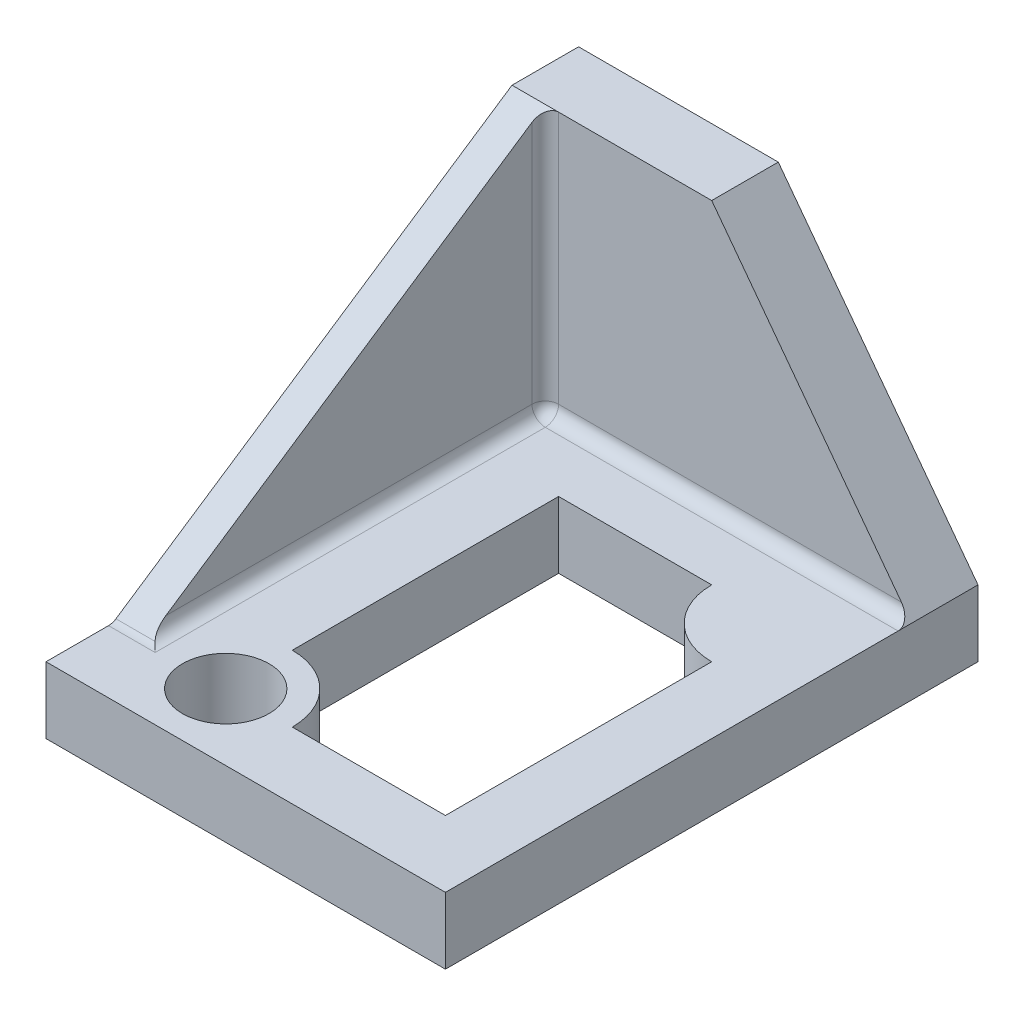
ISO-10303-21;
HEADER;
FILE_DESCRIPTION(('STEP AP214'),'2;1');
FILE_NAME('part.step','',(''),(''),'','','');
FILE_SCHEMA(('AUTOMOTIVE_DESIGN { 1 0 10303 214 1 1 1 1 }'));
ENDSEC;
DATA;
#1=APPLICATION_CONTEXT('core data for automotive mechanical design processes');
#2=APPLICATION_PROTOCOL_DEFINITION('international standard','automotive_design',2000,#1);
#3=PRODUCT_CONTEXT('',#1,'mechanical');
#4=PRODUCT('Part','Part','',(#3));
#5=PRODUCT_RELATED_PRODUCT_CATEGORY('part','',(#4));
#6=PRODUCT_DEFINITION_FORMATION('','',#4);
#7=PRODUCT_DEFINITION_CONTEXT('part definition',#1,'design');
#8=PRODUCT_DEFINITION('design','',#6,#7);
#9=PRODUCT_DEFINITION_SHAPE('','',#8);
#10=(LENGTH_UNIT() NAMED_UNIT(*) SI_UNIT(.MILLI.,.METRE.));
#11=(NAMED_UNIT(*) PLANE_ANGLE_UNIT() SI_UNIT($,.RADIAN.));
#12=(NAMED_UNIT(*) SI_UNIT($,.STERADIAN.) SOLID_ANGLE_UNIT());
#13=UNCERTAINTY_MEASURE_WITH_UNIT(LENGTH_MEASURE(1.E-05),#10,'distance_accuracy_value','');
#14=(GEOMETRIC_REPRESENTATION_CONTEXT(3) GLOBAL_UNCERTAINTY_ASSIGNED_CONTEXT((#13)) GLOBAL_UNIT_ASSIGNED_CONTEXT((#10,
#11,#12)) REPRESENTATION_CONTEXT('',''));
#15=CARTESIAN_POINT('',(0.,0.,0.));
#16=DIRECTION('',(0.,0.,1.));
#17=DIRECTION('',(1.,0.,0.));
#18=AXIS2_PLACEMENT_3D('',#15,#16,#17);
#19=CARTESIAN_POINT('',(0.,0.,101.6));
#20=DIRECTION('',(0.,-1.,0.));
#21=DIRECTION('',(0.,0.,-1.));
#22=AXIS2_PLACEMENT_3D('',#19,#20,#21);
#23=PLANE('',#22);
#24=CARTESIAN_POINT('',(21.59,0.,88.9));
#25=DIRECTION('',(0.,1.,0.));
#26=DIRECTION('',(0.,0.,1.));
#27=AXIS2_PLACEMENT_3D('',#24,#25,#26);
#28=CIRCLE('',#27,8.255);
#29=CARTESIAN_POINT('',(21.59,0.,97.155));
#30=VERTEX_POINT('',#29);
#31=EDGE_CURVE('E417',#30,#30,#28,.T.);
#32=ORIENTED_EDGE('',*,*,#31,.F.);
#33=EDGE_LOOP('',(#32));
#34=FACE_BOUND('',#33,.T.);
#35=DIRECTION('',(0.,0.,1.));
#36=VECTOR('',#35,1.);
#37=CARTESIAN_POINT('',(21.59,0.,25.4));
#38=LINE('',#37,#36);
#39=CARTESIAN_POINT('',(21.59,0.,25.4));
#40=VERTEX_POINT('',#39);
#41=CARTESIAN_POINT('',(21.59,0.,76.2));
#42=VERTEX_POINT('',#41);
#43=EDGE_CURVE('E156',#40,#42,#38,.T.);
#44=ORIENTED_EDGE('',*,*,#43,.F.);
#45=DIRECTION('',(-1.,0.,0.));
#46=VECTOR('',#45,1.);
#47=CARTESIAN_POINT('',(50.8,0.,25.4));
#48=LINE('',#47,#46);
#49=CARTESIAN_POINT('',(50.8,0.,25.4));
#50=VERTEX_POINT('',#49);
#51=EDGE_CURVE('E39',#50,#40,#48,.T.);
#52=ORIENTED_EDGE('',*,*,#51,.F.);
#53=CARTESIAN_POINT('',(63.5,0.,25.4));
#54=DIRECTION('',(0.,-1.,0.));
#55=DIRECTION('',(0.,0.,-1.));
#56=AXIS2_PLACEMENT_3D('',#53,#54,#55);
#57=CIRCLE('',#56,12.7);
#58=CARTESIAN_POINT('',(63.5,0.,38.1));
#59=VERTEX_POINT('',#58);
#60=EDGE_CURVE('E171',#59,#50,#57,.T.);
#61=ORIENTED_EDGE('',*,*,#60,.F.);
#62=DIRECTION('',(0.,0.,-1.));
#63=VECTOR('',#62,1.);
#64=CARTESIAN_POINT('',(63.5,0.,88.9));
#65=LINE('',#64,#63);
#66=CARTESIAN_POINT('',(63.5,0.,88.9));
#67=VERTEX_POINT('',#66);
#68=EDGE_CURVE('E165',#67,#59,#65,.T.);
#69=ORIENTED_EDGE('',*,*,#68,.F.);
#70=DIRECTION('',(1.,0.,0.));
#71=VECTOR('',#70,1.);
#72=CARTESIAN_POINT('',(34.29,0.,88.9));
#73=LINE('',#72,#71);
#74=CARTESIAN_POINT('',(34.29,0.,88.9));
#75=VERTEX_POINT('',#74);
#76=EDGE_CURVE('E163',#75,#67,#73,.T.);
#77=ORIENTED_EDGE('',*,*,#76,.F.);
#78=CARTESIAN_POINT('',(21.59,0.,88.9));
#79=DIRECTION('',(0.,-1.,0.));
#80=DIRECTION('',(0.,0.,1.));
#81=AXIS2_PLACEMENT_3D('',#78,#79,#80);
#82=CIRCLE('',#81,12.7);
#83=EDGE_CURVE('E147',#42,#75,#82,.T.);
#84=ORIENTED_EDGE('',*,*,#83,.F.);
#85=EDGE_LOOP('',(#44,#52,#61,#69,#77,#84));
#86=FACE_BOUND('',#85,.T.);
#87=DIRECTION('',(0.,0.,-1.));
#88=VECTOR('',#87,1.);
#89=CARTESIAN_POINT('',(76.2,0.,101.6));
#90=LINE('',#89,#88);
#91=CARTESIAN_POINT('',(76.2,0.,101.6));
#92=VERTEX_POINT('',#91);
#93=CARTESIAN_POINT('',(76.2,0.,15.24));
#94=VERTEX_POINT('',#93);
#95=EDGE_CURVE('E255',#92,#94,#90,.T.);
#96=ORIENTED_EDGE('',*,*,#95,.T.);
#97=DIRECTION('',(-1.,0.,0.));
#98=VECTOR('',#97,1.);
#99=CARTESIAN_POINT('',(6.35,0.,15.24));
#100=LINE('',#99,#98);
#101=CARTESIAN_POINT('',(8.89,0.,15.24));
#102=VERTEX_POINT('',#101);
#103=EDGE_CURVE('E269',#94,#102,#100,.T.);
#104=ORIENTED_EDGE('',*,*,#103,.T.);
#105=DIRECTION('',(0.,0.,1.));
#106=VECTOR('',#105,1.);
#107=CARTESIAN_POINT('',(8.89,0.,101.6));
#108=LINE('',#107,#106);
#109=CARTESIAN_POINT('',(8.89,0.,89.6690501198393));
#110=VERTEX_POINT('',#109);
#111=EDGE_CURVE('E321',#102,#110,#108,.T.);
#112=ORIENTED_EDGE('',*,*,#111,.T.);
#113=DIRECTION('',(-1.,0.,0.));
#114=VECTOR('',#113,1.);
#115=CARTESIAN_POINT('',(0.,0.,89.6690501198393));
#116=LINE('',#115,#114);
#117=CARTESIAN_POINT('',(0.,0.,89.6690501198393));
#118=VERTEX_POINT('',#117);
#119=EDGE_CURVE('E322',#110,#118,#116,.T.);
#120=ORIENTED_EDGE('',*,*,#119,.T.);
#121=DIRECTION('',(0.,0.,-1.));
#122=VECTOR('',#121,1.);
#123=CARTESIAN_POINT('',(0.,0.,101.6));
#124=LINE('',#123,#122);
#125=CARTESIAN_POINT('',(0.,0.,101.6));
#126=VERTEX_POINT('',#125);
#127=EDGE_CURVE('E252',#126,#118,#124,.T.);
#128=ORIENTED_EDGE('',*,*,#127,.F.);
#129=DIRECTION('',(-1.,0.,0.));
#130=VECTOR('',#129,1.);
#131=CARTESIAN_POINT('',(0.,0.,101.6));
#132=LINE('',#131,#130);
#133=EDGE_CURVE('E250',#92,#126,#132,.T.);
#134=ORIENTED_EDGE('',*,*,#133,.F.);
#135=EDGE_LOOP('',(#96,#104,#112,#120,#128,#134));
#136=FACE_BOUND('',#135,.T.);
#137=ADVANCED_FACE('F24',(#34,#86,#136),#23,.F.);
#138=CARTESIAN_POINT('',(6.35,59.2666666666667,0.));
#139=DIRECTION('',(1.,0.,0.));
#140=DIRECTION('',(0.,0.,-1.));
#141=AXIS2_PLACEMENT_3D('',#138,#139,#140);
#142=PLANE('',#141);
#143=DIRECTION('',(0.,0.,1.));
#144=VECTOR('',#143,1.);
#145=CARTESIAN_POINT('',(6.35,2.54,0.));
#146=LINE('',#145,#144);
#147=CARTESIAN_POINT('',(6.35,2.54,85.09));
#148=VERTEX_POINT('',#147);
#149=CARTESIAN_POINT('',(6.35,2.54,15.24));
#150=VERTEX_POINT('',#149);
#151=EDGE_CURVE('E264',#148,#150,#146,.F.);
#152=ORIENTED_EDGE('',*,*,#151,.T.);
#153=DIRECTION('',(0.,1.,0.));
#154=VECTOR('',#153,1.);
#155=CARTESIAN_POINT('',(6.35,59.2666666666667,15.24));
#156=LINE('',#155,#154);
#157=CARTESIAN_POINT('',(6.35,49.1066666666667,15.24));
#158=VERTEX_POINT('',#157);
#159=EDGE_CURVE('E292',#150,#158,#156,.T.);
#160=ORIENTED_EDGE('',*,*,#159,.T.);
#161=DIRECTION('',(0.,0.554700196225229,-0.832050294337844));
#162=VECTOR('',#161,1.);
#163=CARTESIAN_POINT('',(6.35,50.8,12.7));
#164=LINE('',#163,#162);
#165=EDGE_CURVE('E226',#148,#158,#164,.T.);
#166=ORIENTED_EDGE('',*,*,#165,.F.);
#167=EDGE_LOOP('',(#152,#160,#166));
#168=FACE_BOUND('',#167,.T.);
#169=ADVANCED_FACE('F289',(#168),#142,.T.);
#170=CARTESIAN_POINT('',(0.,-12.7,101.6));
#171=DIRECTION('',(1.,0.,0.));
#172=DIRECTION('',(0.,1.,0.));
#173=AXIS2_PLACEMENT_3D('',#170,#171,#172);
#174=PLANE('',#173);
#175=DIRECTION('',(0.,-1.,0.));
#176=VECTOR('',#175,1.);
#177=CARTESIAN_POINT('',(0.,-12.7,0.));
#178=LINE('',#177,#176);
#179=CARTESIAN_POINT('',(0.,50.8,0.));
#180=VERTEX_POINT('',#179);
#181=CARTESIAN_POINT('',(0.,-12.7,0.));
#182=VERTEX_POINT('',#181);
#183=EDGE_CURVE('E233',#180,#182,#178,.T.);
#184=ORIENTED_EDGE('',*,*,#183,.T.);
#185=DIRECTION('',(0.,0.,-1.));
#186=VECTOR('',#185,1.);
#187=CARTESIAN_POINT('',(0.,-12.7,101.6));
#188=LINE('',#187,#186);
#189=CARTESIAN_POINT('',(0.,-12.7,101.6));
#190=VERTEX_POINT('',#189);
#191=EDGE_CURVE('E261',#190,#182,#188,.T.);
#192=ORIENTED_EDGE('',*,*,#191,.F.);
#193=DIRECTION('',(0.,-1.,0.));
#194=VECTOR('',#193,1.);
#195=CARTESIAN_POINT('',(0.,-12.7,101.6));
#196=LINE('',#195,#194);
#197=EDGE_CURVE('E243',#126,#190,#196,.T.);
#198=ORIENTED_EDGE('',*,*,#197,.F.);
#199=ORIENTED_EDGE('',*,*,#127,.T.);
#200=CARTESIAN_POINT('',(0.,2.54,89.6690501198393));
#201=DIRECTION('',(1.,0.,0.));
#202=DIRECTION('',(0.,1.,0.));
#203=AXIS2_PLACEMENT_3D('',#200,#201,#202);
#204=CIRCLE('',#203,2.54);
#205=CARTESIAN_POINT('',(0.,0.426592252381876,88.2601116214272));
#206=VERTEX_POINT('',#205);
#207=EDGE_CURVE('E11',#118,#206,#204,.T.);
#208=ORIENTED_EDGE('',*,*,#207,.T.);
#209=DIRECTION('',(0.,0.554700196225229,-0.832050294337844));
#210=VECTOR('',#209,1.);
#211=CARTESIAN_POINT('',(0.,50.8,12.7));
#212=LINE('',#211,#210);
#213=CARTESIAN_POINT('',(0.,50.8,12.7));
#214=VERTEX_POINT('',#213);
#215=EDGE_CURVE('E220',#206,#214,#212,.T.);
#216=ORIENTED_EDGE('',*,*,#215,.T.);
#217=DIRECTION('',(0.,0.,-1.));
#218=VECTOR('',#217,1.);
#219=CARTESIAN_POINT('',(0.,50.8,0.));
#220=LINE('',#219,#218);
#221=EDGE_CURVE('E223',#214,#180,#220,.T.);
#222=ORIENTED_EDGE('',*,*,#221,.T.);
#223=EDGE_LOOP('',(#184,#192,#198,#199,#208,#216,#222));
#224=FACE_BOUND('',#223,.T.);
#225=ADVANCED_FACE('F26',(#224),#174,.F.);
#226=CARTESIAN_POINT('',(76.2,-12.7,101.6));
#227=DIRECTION('',(0.,1.,0.));
#228=DIRECTION('',(-1.,0.,0.));
#229=AXIS2_PLACEMENT_3D('',#226,#227,#228);
#230=PLANE('',#229);
#231=CARTESIAN_POINT('',(21.59,-12.7,88.9));
#232=DIRECTION('',(0.,1.,0.));
#233=DIRECTION('',(0.,0.,1.));
#234=AXIS2_PLACEMENT_3D('',#231,#232,#233);
#235=CIRCLE('',#234,8.255);
#236=CARTESIAN_POINT('',(21.59,-12.7,97.155));
#237=VERTEX_POINT('',#236);
#238=EDGE_CURVE('E415',#237,#237,#235,.T.);
#239=ORIENTED_EDGE('',*,*,#238,.T.);
#240=EDGE_LOOP('',(#239));
#241=FACE_BOUND('',#240,.T.);
#242=CARTESIAN_POINT('',(63.5,-12.7,25.4));
#243=DIRECTION('',(0.,-1.,0.));
#244=DIRECTION('',(0.,0.,-1.));
#245=AXIS2_PLACEMENT_3D('',#242,#243,#244);
#246=CIRCLE('',#245,12.7);
#247=CARTESIAN_POINT('',(63.5,-12.7,38.1));
#248=VERTEX_POINT('',#247);
#249=CARTESIAN_POINT('',(50.8,-12.7,25.4));
#250=VERTEX_POINT('',#249);
#251=EDGE_CURVE('E186',#248,#250,#246,.T.);
#252=ORIENTED_EDGE('',*,*,#251,.T.);
#253=DIRECTION('',(-1.,0.,0.));
#254=VECTOR('',#253,1.);
#255=CARTESIAN_POINT('',(50.8,-12.7,25.4));
#256=LINE('',#255,#254);
#257=CARTESIAN_POINT('',(21.59,-12.7,25.4));
#258=VERTEX_POINT('',#257);
#259=EDGE_CURVE('E174',#250,#258,#256,.T.);
#260=ORIENTED_EDGE('',*,*,#259,.T.);
#261=DIRECTION('',(0.,0.,1.));
#262=VECTOR('',#261,1.);
#263=CARTESIAN_POINT('',(21.59,-12.7,25.4));
#264=LINE('',#263,#262);
#265=CARTESIAN_POINT('',(21.59,-12.7,76.2));
#266=VERTEX_POINT('',#265);
#267=EDGE_CURVE('E177',#258,#266,#264,.T.);
#268=ORIENTED_EDGE('',*,*,#267,.T.);
#269=CARTESIAN_POINT('',(21.59,-12.7,88.9));
#270=DIRECTION('',(0.,-1.,0.));
#271=DIRECTION('',(0.,0.,1.));
#272=AXIS2_PLACEMENT_3D('',#269,#270,#271);
#273=CIRCLE('',#272,12.7);
#274=CARTESIAN_POINT('',(34.29,-12.7,88.9));
#275=VERTEX_POINT('',#274);
#276=EDGE_CURVE('E47',#266,#275,#273,.T.);
#277=ORIENTED_EDGE('',*,*,#276,.T.);
#278=DIRECTION('',(1.,0.,0.));
#279=VECTOR('',#278,1.);
#280=CARTESIAN_POINT('',(34.29,-12.7,88.9));
#281=LINE('',#280,#279);
#282=CARTESIAN_POINT('',(63.5,-12.7,88.9));
#283=VERTEX_POINT('',#282);
#284=EDGE_CURVE('E180',#275,#283,#281,.T.);
#285=ORIENTED_EDGE('',*,*,#284,.T.);
#286=DIRECTION('',(0.,0.,-1.));
#287=VECTOR('',#286,1.);
#288=CARTESIAN_POINT('',(63.5,-12.7,88.9));
#289=LINE('',#288,#287);
#290=EDGE_CURVE('E183',#283,#248,#289,.T.);
#291=ORIENTED_EDGE('',*,*,#290,.T.);
#292=EDGE_LOOP('',(#252,#260,#268,#277,#285,#291));
#293=FACE_BOUND('',#292,.T.);
#294=DIRECTION('',(1.,0.,0.));
#295=VECTOR('',#294,1.);
#296=CARTESIAN_POINT('',(76.2,-12.7,0.));
#297=LINE('',#296,#295);
#298=CARTESIAN_POINT('',(76.2,-12.7,0.));
#299=VERTEX_POINT('',#298);
#300=EDGE_CURVE('E238',#182,#299,#297,.T.);
#301=ORIENTED_EDGE('',*,*,#300,.T.);
#302=DIRECTION('',(0.,0.,-1.));
#303=VECTOR('',#302,1.);
#304=CARTESIAN_POINT('',(76.2,-12.7,101.6));
#305=LINE('',#304,#303);
#306=CARTESIAN_POINT('',(76.2,-12.7,101.6));
#307=VERTEX_POINT('',#306);
#308=EDGE_CURVE('E298',#307,#299,#305,.T.);
#309=ORIENTED_EDGE('',*,*,#308,.F.);
#310=DIRECTION('',(1.,0.,0.));
#311=VECTOR('',#310,1.);
#312=CARTESIAN_POINT('',(76.2,-12.7,101.6));
#313=LINE('',#312,#311);
#314=EDGE_CURVE('E246',#190,#307,#313,.T.);
#315=ORIENTED_EDGE('',*,*,#314,.F.);
#316=ORIENTED_EDGE('',*,*,#191,.T.);
#317=EDGE_LOOP('',(#301,#309,#315,#316));
#318=FACE_BOUND('',#317,.T.);
#319=ADVANCED_FACE('F348',(#241,#293,#318),#230,.F.);
#320=CARTESIAN_POINT('',(76.2,0.,101.6));
#321=DIRECTION('',(-1.,0.,0.));
#322=DIRECTION('',(0.,0.,1.));
#323=AXIS2_PLACEMENT_3D('',#320,#321,#322);
#324=PLANE('',#323);
#325=DIRECTION('',(0.,1.,0.));
#326=VECTOR('',#325,1.);
#327=CARTESIAN_POINT('',(76.2,0.,0.));
#328=LINE('',#327,#326);
#329=CARTESIAN_POINT('',(76.2,0.,0.));
#330=VERTEX_POINT('',#329);
#331=EDGE_CURVE('E240',#299,#330,#328,.T.);
#332=ORIENTED_EDGE('',*,*,#331,.T.);
#333=DIRECTION('',(0.,0.,-1.));
#334=VECTOR('',#333,1.);
#335=CARTESIAN_POINT('',(76.2,0.,12.7));
#336=LINE('',#335,#334);
#337=EDGE_CURVE('E218',#94,#330,#336,.T.);
#338=ORIENTED_EDGE('',*,*,#337,.F.);
#339=ORIENTED_EDGE('',*,*,#95,.F.);
#340=DIRECTION('',(0.,1.,0.));
#341=VECTOR('',#340,1.);
#342=CARTESIAN_POINT('',(76.2,0.,101.6));
#343=LINE('',#342,#341);
#344=EDGE_CURVE('E248',#307,#92,#343,.T.);
#345=ORIENTED_EDGE('',*,*,#344,.F.);
#346=ORIENTED_EDGE('',*,*,#308,.T.);
#347=EDGE_LOOP('',(#332,#338,#339,#345,#346));
#348=FACE_BOUND('',#347,.T.);
#349=ADVANCED_FACE('F346',(#348),#324,.F.);
#350=CARTESIAN_POINT('',(0.,-12.7,101.6));
#351=DIRECTION('',(0.,0.,1.));
#352=DIRECTION('',(1.,0.,0.));
#353=AXIS2_PLACEMENT_3D('',#350,#351,#352);
#354=PLANE('',#353);
#355=ORIENTED_EDGE('',*,*,#197,.T.);
#356=ORIENTED_EDGE('',*,*,#314,.T.);
#357=ORIENTED_EDGE('',*,*,#344,.T.);
#358=ORIENTED_EDGE('',*,*,#133,.T.);
#359=EDGE_LOOP('',(#355,#356,#357,#358));
#360=FACE_BOUND('',#359,.T.);
#361=ADVANCED_FACE('F345',(#360),#354,.T.);
#362=CARTESIAN_POINT('',(0.,-12.7,0.));
#363=DIRECTION('',(0.,0.,1.));
#364=DIRECTION('',(1.,0.,0.));
#365=AXIS2_PLACEMENT_3D('',#362,#363,#364);
#366=PLANE('',#365);
#367=ORIENTED_EDGE('',*,*,#183,.F.);
#368=DIRECTION('',(-1.,0.,0.));
#369=VECTOR('',#368,1.);
#370=CARTESIAN_POINT('',(6.35,50.8,0.));
#371=LINE('',#370,#369);
#372=CARTESIAN_POINT('',(38.1,50.8,0.));
#373=VERTEX_POINT('',#372);
#374=EDGE_CURVE('E230',#373,#180,#371,.T.);
#375=ORIENTED_EDGE('',*,*,#374,.F.);
#376=DIRECTION('',(0.6,-0.8,0.));
#377=VECTOR('',#376,1.);
#378=CARTESIAN_POINT('',(38.1,50.8,0.));
#379=LINE('',#378,#377);
#380=EDGE_CURVE('E209',#373,#330,#379,.T.);
#381=ORIENTED_EDGE('',*,*,#380,.T.);
#382=ORIENTED_EDGE('',*,*,#331,.F.);
#383=ORIENTED_EDGE('',*,*,#300,.F.);
#384=EDGE_LOOP('',(#367,#375,#381,#382,#383));
#385=FACE_BOUND('',#384,.T.);
#386=ADVANCED_FACE('F355',(#385),#366,.F.);
#387=CARTESIAN_POINT('',(6.35,50.8,12.7));
#388=DIRECTION('',(0.,0.832050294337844,0.554700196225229));
#389=DIRECTION('',(0.,-0.554700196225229,0.832050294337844));
#390=AXIS2_PLACEMENT_3D('',#387,#388,#389);
#391=PLANE('',#390);
#392=ORIENTED_EDGE('',*,*,#215,.F.);
#393=DIRECTION('',(-1.,0.,0.));
#394=VECTOR('',#393,1.);
#395=CARTESIAN_POINT('',(6.35,0.426592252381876,88.2601116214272));
#396=LINE('',#395,#394);
#397=CARTESIAN_POINT('',(7.48106150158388,0.426592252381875,88.2601116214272));
#398=VERTEX_POINT('',#397);
#399=EDGE_CURVE('E271',#206,#398,#396,.F.);
#400=ORIENTED_EDGE('',*,*,#399,.T.);
#401=CARTESIAN_POINT('',(8.89,2.54,85.09));
#402=DIRECTION('',(0.,0.832050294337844,0.554700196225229));
#403=DIRECTION('',(0.,-0.554700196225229,0.832050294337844));
#404=AXIS2_PLACEMENT_3D('',#401,#402,#403);
#405=ELLIPSE('',#404,4.57905011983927,2.54);
#406=EDGE_CURVE('E32',#398,#148,#405,.F.);
#407=ORIENTED_EDGE('',*,*,#406,.T.);
#408=ORIENTED_EDGE('',*,*,#165,.T.);
#409=CARTESIAN_POINT('',(8.89,49.1066666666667,15.24));
#410=DIRECTION('',(0.,0.832050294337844,0.554700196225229));
#411=DIRECTION('',(0.,0.554700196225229,-0.832050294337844));
#412=AXIS2_PLACEMENT_3D('',#409,#410,#411);
#413=ELLIPSE('',#412,3.05270007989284,2.54);
#414=CARTESIAN_POINT('',(8.89,50.8,12.7));
#415=VERTEX_POINT('',#414);
#416=EDGE_CURVE('E273',#158,#415,#413,.F.);
#417=ORIENTED_EDGE('',*,*,#416,.T.);
#418=DIRECTION('',(-1.,0.,0.));
#419=VECTOR('',#418,1.);
#420=CARTESIAN_POINT('',(6.35,50.8,12.7));
#421=LINE('',#420,#419);
#422=EDGE_CURVE('E229',#415,#214,#421,.T.);
#423=ORIENTED_EDGE('',*,*,#422,.T.);
#424=EDGE_LOOP('',(#392,#400,#407,#408,#417,#423));
#425=FACE_BOUND('',#424,.T.);
#426=ADVANCED_FACE('F282',(#425),#391,.T.);
#427=CARTESIAN_POINT('',(6.35,50.8,0.));
#428=DIRECTION('',(0.,1.,0.));
#429=DIRECTION('',(0.,0.,1.));
#430=AXIS2_PLACEMENT_3D('',#427,#428,#429);
#431=PLANE('',#430);
#432=ORIENTED_EDGE('',*,*,#221,.F.);
#433=ORIENTED_EDGE('',*,*,#422,.F.);
#434=DIRECTION('',(1.,0.,0.));
#435=VECTOR('',#434,1.);
#436=CARTESIAN_POINT('',(6.35,50.8,12.7));
#437=LINE('',#436,#435);
#438=CARTESIAN_POINT('',(38.1,50.8,12.7));
#439=VERTEX_POINT('',#438);
#440=EDGE_CURVE('E212',#415,#439,#437,.T.);
#441=ORIENTED_EDGE('',*,*,#440,.T.);
#442=DIRECTION('',(0.,0.,-1.));
#443=VECTOR('',#442,1.);
#444=CARTESIAN_POINT('',(38.1,50.8,12.7));
#445=LINE('',#444,#443);
#446=EDGE_CURVE('E217',#439,#373,#445,.T.);
#447=ORIENTED_EDGE('',*,*,#446,.T.);
#448=ORIENTED_EDGE('',*,*,#374,.T.);
#449=EDGE_LOOP('',(#432,#433,#441,#447,#448));
#450=FACE_BOUND('',#449,.T.);
#451=ADVANCED_FACE('F338',(#450),#431,.T.);
#452=CARTESIAN_POINT('',(38.1,50.8,12.7));
#453=DIRECTION('',(0.8,0.6,0.));
#454=DIRECTION('',(-0.6,0.8,0.));
#455=AXIS2_PLACEMENT_3D('',#452,#453,#454);
#456=PLANE('',#455);
#457=ORIENTED_EDGE('',*,*,#380,.F.);
#458=ORIENTED_EDGE('',*,*,#446,.F.);
#459=DIRECTION('',(0.6,-0.8,0.));
#460=VECTOR('',#459,1.);
#461=CARTESIAN_POINT('',(38.1,50.8,12.7));
#462=LINE('',#461,#460);
#463=CARTESIAN_POINT('',(74.295,2.53999999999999,12.7));
#464=VERTEX_POINT('',#463);
#465=EDGE_CURVE('E214',#439,#464,#462,.T.);
#466=ORIENTED_EDGE('',*,*,#465,.T.);
#467=CARTESIAN_POINT('',(74.295,2.54,15.24));
#468=DIRECTION('',(0.8,0.6,0.));
#469=DIRECTION('',(0.6,-0.8,0.));
#470=AXIS2_PLACEMENT_3D('',#467,#468,#469);
#471=ELLIPSE('',#470,3.175,2.54);
#472=EDGE_CURVE('E276',#464,#94,#471,.F.);
#473=ORIENTED_EDGE('',*,*,#472,.T.);
#474=ORIENTED_EDGE('',*,*,#337,.T.);
#475=EDGE_LOOP('',(#457,#458,#466,#473,#474));
#476=FACE_BOUND('',#475,.T.);
#477=ADVANCED_FACE('F314',(#476),#456,.T.);
#478=CARTESIAN_POINT('',(6.35,50.8,12.7));
#479=DIRECTION('',(0.,0.,-1.));
#480=DIRECTION('',(-1.,0.,0.));
#481=AXIS2_PLACEMENT_3D('',#478,#479,#480);
#482=PLANE('',#481);
#483=ORIENTED_EDGE('',*,*,#440,.F.);
#484=DIRECTION('',(0.,1.,0.));
#485=VECTOR('',#484,1.);
#486=CARTESIAN_POINT('',(8.89,50.8,12.7));
#487=LINE('',#486,#485);
#488=CARTESIAN_POINT('',(8.89,2.54,12.7));
#489=VERTEX_POINT('',#488);
#490=EDGE_CURVE('E324',#415,#489,#487,.F.);
#491=ORIENTED_EDGE('',*,*,#490,.T.);
#492=DIRECTION('',(-1.,0.,0.));
#493=VECTOR('',#492,1.);
#494=CARTESIAN_POINT('',(76.2,2.54,12.7));
#495=LINE('',#494,#493);
#496=EDGE_CURVE('E296',#489,#464,#495,.F.);
#497=ORIENTED_EDGE('',*,*,#496,.T.);
#498=ORIENTED_EDGE('',*,*,#465,.F.);
#499=EDGE_LOOP('',(#483,#491,#497,#498));
#500=FACE_BOUND('',#499,.T.);
#501=ADVANCED_FACE('F330',(#500),#482,.F.);
#502=CARTESIAN_POINT('',(0.,2.54,89.6690501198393));
#503=DIRECTION('',(-1.,0.,0.));
#504=DIRECTION('',(0.,0.,1.));
#505=AXIS2_PLACEMENT_3D('',#502,#503,#504);
#506=CYLINDRICAL_SURFACE('',#505,2.54);
#507=ORIENTED_EDGE('',*,*,#207,.F.);
#508=ORIENTED_EDGE('',*,*,#119,.F.);
#509=CARTESIAN_POINT('',(8.89,2.54,89.6690501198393));
#510=DIRECTION('',(-0.707106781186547,0.,0.707106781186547));
#511=DIRECTION('',(-0.707106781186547,0.,-0.707106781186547));
#512=AXIS2_PLACEMENT_3D('',#509,#510,#511);
#513=ELLIPSE('',#512,3.59210244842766,2.54);
#514=EDGE_CURVE('E206',#398,#110,#513,.T.);
#515=ORIENTED_EDGE('',*,*,#514,.F.);
#516=ORIENTED_EDGE('',*,*,#399,.F.);
#517=EDGE_LOOP('',(#507,#508,#515,#516));
#518=FACE_BOUND('',#517,.T.);
#519=ADVANCED_FACE('F343',(#518),#506,.F.);
#520=CARTESIAN_POINT('',(0.,2.54,15.24));
#521=DIRECTION('',(1.,0.,0.));
#522=DIRECTION('',(0.,0.,-1.));
#523=AXIS2_PLACEMENT_3D('',#520,#521,#522);
#524=CYLINDRICAL_SURFACE('',#523,2.54);
#525=ORIENTED_EDGE('',*,*,#472,.F.);
#526=ORIENTED_EDGE('',*,*,#496,.F.);
#527=CARTESIAN_POINT('',(8.89,2.54,15.24));
#528=DIRECTION('',(1.,0.,0.));
#529=DIRECTION('',(0.,0.,-1.));
#530=AXIS2_PLACEMENT_3D('',#527,#528,#529);
#531=CIRCLE('',#530,2.54);
#532=EDGE_CURVE('E203',#102,#489,#531,.T.);
#533=ORIENTED_EDGE('',*,*,#532,.F.);
#534=ORIENTED_EDGE('',*,*,#103,.F.);
#535=EDGE_LOOP('',(#525,#526,#533,#534));
#536=FACE_BOUND('',#535,.T.);
#537=ADVANCED_FACE('F320',(#536),#524,.F.);
#538=CARTESIAN_POINT('',(8.89,2.54,101.6));
#539=DIRECTION('',(0.,0.,1.));
#540=DIRECTION('',(1.,0.,0.));
#541=AXIS2_PLACEMENT_3D('',#538,#539,#540);
#542=CYLINDRICAL_SURFACE('',#541,2.54);
#543=ORIENTED_EDGE('',*,*,#514,.T.);
#544=ORIENTED_EDGE('',*,*,#111,.F.);
#545=CARTESIAN_POINT('',(8.89,2.54,15.24));
#546=DIRECTION('',(0.,0.,1.));
#547=DIRECTION('',(0.,-1.,0.));
#548=AXIS2_PLACEMENT_3D('',#545,#546,#547);
#549=CIRCLE('',#548,2.54);
#550=EDGE_CURVE('E200',#150,#102,#549,.T.);
#551=ORIENTED_EDGE('',*,*,#550,.F.);
#552=ORIENTED_EDGE('',*,*,#151,.F.);
#553=ORIENTED_EDGE('',*,*,#406,.F.);
#554=EDGE_LOOP('',(#543,#544,#551,#552,#553));
#555=FACE_BOUND('',#554,.T.);
#556=ADVANCED_FACE('F293',(#555),#542,.F.);
#557=CARTESIAN_POINT('',(8.89,2.54,15.24));
#558=DIRECTION('',(0.,0.,1.));
#559=DIRECTION('',(1.,0.,0.));
#560=AXIS2_PLACEMENT_3D('',#557,#558,#559);
#561=SPHERICAL_SURFACE('',#560,2.54);
#562=ORIENTED_EDGE('',*,*,#550,.T.);
#563=ORIENTED_EDGE('',*,*,#532,.T.);
#564=CARTESIAN_POINT('',(8.89,2.54,15.24));
#565=DIRECTION('',(0.,1.,0.));
#566=DIRECTION('',(0.,0.,1.));
#567=AXIS2_PLACEMENT_3D('',#564,#565,#566);
#568=CIRCLE('',#567,2.54);
#569=EDGE_CURVE('E191',#150,#489,#568,.F.);
#570=ORIENTED_EDGE('',*,*,#569,.F.);
#571=EDGE_LOOP('',(#562,#563,#570));
#572=FACE_BOUND('',#571,.T.);
#573=ADVANCED_FACE('F333',(#572),#561,.F.);
#574=CARTESIAN_POINT('',(8.89,59.2666666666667,15.24));
#575=DIRECTION('',(0.,1.,0.));
#576=DIRECTION('',(0.,0.,1.));
#577=AXIS2_PLACEMENT_3D('',#574,#575,#576);
#578=CYLINDRICAL_SURFACE('',#577,2.54);
#579=ORIENTED_EDGE('',*,*,#569,.T.);
#580=ORIENTED_EDGE('',*,*,#490,.F.);
#581=ORIENTED_EDGE('',*,*,#416,.F.);
#582=ORIENTED_EDGE('',*,*,#159,.F.);
#583=EDGE_LOOP('',(#579,#580,#581,#582));
#584=FACE_BOUND('',#583,.T.);
#585=ADVANCED_FACE('F335',(#584),#578,.F.);
#586=CARTESIAN_POINT('',(50.8,-12.7,25.4));
#587=DIRECTION('',(0.,0.,-1.));
#588=DIRECTION('',(-1.,0.,0.));
#589=AXIS2_PLACEMENT_3D('',#586,#587,#588);
#590=PLANE('',#589);
#591=ORIENTED_EDGE('',*,*,#51,.T.);
#592=DIRECTION('',(0.,1.,0.));
#593=VECTOR('',#592,1.);
#594=CARTESIAN_POINT('',(21.59,-12.7,25.4));
#595=LINE('',#594,#593);
#596=EDGE_CURVE('E153',#258,#40,#595,.T.);
#597=ORIENTED_EDGE('',*,*,#596,.F.);
#598=ORIENTED_EDGE('',*,*,#259,.F.);
#599=DIRECTION('',(0.,1.,0.));
#600=VECTOR('',#599,1.);
#601=CARTESIAN_POINT('',(50.8,-12.7,25.4));
#602=LINE('',#601,#600);
#603=EDGE_CURVE('E189',#250,#50,#602,.T.);
#604=ORIENTED_EDGE('',*,*,#603,.T.);
#605=EDGE_LOOP('',(#591,#597,#598,#604));
#606=FACE_BOUND('',#605,.T.);
#607=ADVANCED_FACE('F389',(#606),#590,.F.);
#608=CARTESIAN_POINT('',(63.5,-12.7,25.4));
#609=DIRECTION('',(0.,1.,0.));
#610=DIRECTION('',(0.,0.,1.));
#611=AXIS2_PLACEMENT_3D('',#608,#609,#610);
#612=CYLINDRICAL_SURFACE('',#611,12.7);
#613=ORIENTED_EDGE('',*,*,#60,.T.);
#614=ORIENTED_EDGE('',*,*,#603,.F.);
#615=ORIENTED_EDGE('',*,*,#251,.F.);
#616=DIRECTION('',(0.,1.,0.));
#617=VECTOR('',#616,1.);
#618=CARTESIAN_POINT('',(63.5,-12.7,38.1));
#619=LINE('',#618,#617);
#620=EDGE_CURVE('E192',#248,#59,#619,.T.);
#621=ORIENTED_EDGE('',*,*,#620,.T.);
#622=EDGE_LOOP('',(#613,#614,#615,#621));
#623=FACE_BOUND('',#622,.T.);
#624=ADVANCED_FACE('F392',(#623),#612,.T.);
#625=CARTESIAN_POINT('',(63.5,-12.7,88.9));
#626=DIRECTION('',(1.,0.,0.));
#627=DIRECTION('',(0.,0.,-1.));
#628=AXIS2_PLACEMENT_3D('',#625,#626,#627);
#629=PLANE('',#628);
#630=ORIENTED_EDGE('',*,*,#68,.T.);
#631=ORIENTED_EDGE('',*,*,#620,.F.);
#632=ORIENTED_EDGE('',*,*,#290,.F.);
#633=DIRECTION('',(0.,1.,0.));
#634=VECTOR('',#633,1.);
#635=CARTESIAN_POINT('',(63.5,-12.7,88.9));
#636=LINE('',#635,#634);
#637=EDGE_CURVE('E194',#283,#67,#636,.T.);
#638=ORIENTED_EDGE('',*,*,#637,.T.);
#639=EDGE_LOOP('',(#630,#631,#632,#638));
#640=FACE_BOUND('',#639,.T.);
#641=ADVANCED_FACE('F400',(#640),#629,.F.);
#642=CARTESIAN_POINT('',(34.29,-12.7,88.9));
#643=DIRECTION('',(0.,0.,1.));
#644=DIRECTION('',(1.,0.,0.));
#645=AXIS2_PLACEMENT_3D('',#642,#643,#644);
#646=PLANE('',#645);
#647=ORIENTED_EDGE('',*,*,#76,.T.);
#648=ORIENTED_EDGE('',*,*,#637,.F.);
#649=ORIENTED_EDGE('',*,*,#284,.F.);
#650=DIRECTION('',(0.,1.,0.));
#651=VECTOR('',#650,1.);
#652=CARTESIAN_POINT('',(34.29,-12.7,88.9));
#653=LINE('',#652,#651);
#654=EDGE_CURVE('E152',#275,#75,#653,.T.);
#655=ORIENTED_EDGE('',*,*,#654,.T.);
#656=EDGE_LOOP('',(#647,#648,#649,#655));
#657=FACE_BOUND('',#656,.T.);
#658=ADVANCED_FACE('F397',(#657),#646,.F.);
#659=CARTESIAN_POINT('',(21.59,-12.7,88.9));
#660=DIRECTION('',(0.,1.,0.));
#661=DIRECTION('',(0.,0.,1.));
#662=AXIS2_PLACEMENT_3D('',#659,#660,#661);
#663=CYLINDRICAL_SURFACE('',#662,12.7);
#664=ORIENTED_EDGE('',*,*,#83,.T.);
#665=ORIENTED_EDGE('',*,*,#654,.F.);
#666=ORIENTED_EDGE('',*,*,#276,.F.);
#667=DIRECTION('',(0.,1.,0.));
#668=VECTOR('',#667,1.);
#669=CARTESIAN_POINT('',(21.59,-12.7,76.2));
#670=LINE('',#669,#668);
#671=EDGE_CURVE('E143',#266,#42,#670,.T.);
#672=ORIENTED_EDGE('',*,*,#671,.T.);
#673=EDGE_LOOP('',(#664,#665,#666,#672));
#674=FACE_BOUND('',#673,.T.);
#675=ADVANCED_FACE('F145',(#674),#663,.T.);
#676=CARTESIAN_POINT('',(21.59,-12.7,25.4));
#677=DIRECTION('',(-1.,0.,0.));
#678=DIRECTION('',(0.,0.,1.));
#679=AXIS2_PLACEMENT_3D('',#676,#677,#678);
#680=PLANE('',#679);
#681=ORIENTED_EDGE('',*,*,#43,.T.);
#682=ORIENTED_EDGE('',*,*,#671,.F.);
#683=ORIENTED_EDGE('',*,*,#267,.F.);
#684=ORIENTED_EDGE('',*,*,#596,.T.);
#685=EDGE_LOOP('',(#681,#682,#683,#684));
#686=FACE_BOUND('',#685,.T.);
#687=ADVANCED_FACE('F157',(#686),#680,.F.);
#688=CARTESIAN_POINT('',(21.59,-12.7,88.9));
#689=DIRECTION('',(0.,1.,0.));
#690=DIRECTION('',(0.,0.,1.));
#691=AXIS2_PLACEMENT_3D('',#688,#689,#690);
#692=CYLINDRICAL_SURFACE('',#691,8.255);
#693=ORIENTED_EDGE('',*,*,#238,.F.);
#694=EDGE_LOOP('',(#693));
#695=FACE_BOUND('',#694,.T.);
#696=ORIENTED_EDGE('',*,*,#31,.T.);
#697=EDGE_LOOP('',(#696));
#698=FACE_BOUND('',#697,.T.);
#699=ADVANCED_FACE('F394',(#695,#698),#692,.F.);
#700=CLOSED_SHELL('',(#137,#169,#225,#319,#349,#361,#386,#426,#451,#477,#501,#519,#537,#556,
#573,#585,#607,#624,#641,#658,#675,#687,#699));
#701=MANIFOLD_SOLID_BREP('B2',#700);
#702=ADVANCED_BREP_SHAPE_REPRESENTATION('',(#18,#701),#14);
#703=SHAPE_DEFINITION_REPRESENTATION(#9,#702);
ENDSEC;
END-ISO-10303-21;
